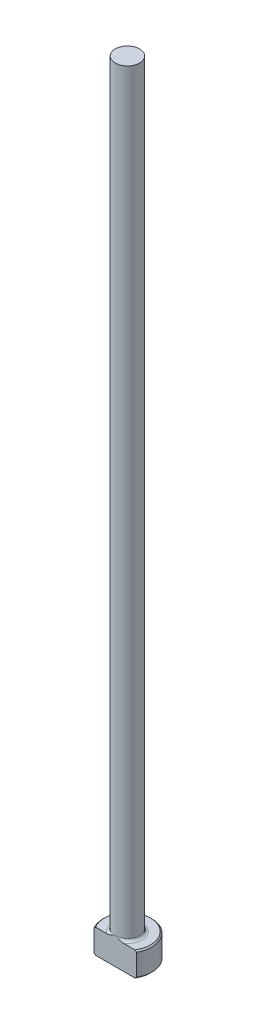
from build123d import *

# Parameters (mm, degrees)
CHAMFER1_SIZE = 0.254
FILLET1_R     = 0.508
KEY_DEPTH     = 153.548755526


with BuildPart() as part:
    # Sketch1 → Revolve1 (revolve)
    with BuildSketch(Plane.XY, mode=Mode.PRIVATE) as revolve1_sk:
        Polygon((0, 0), (-4.7625, 0), (-4.7625, 4.7498), (-2.38125, 4.7498), (-2.38125, 152.4), (0, 152.4), align=None)
    revolve(revolve1_sk.sketch.rotate(Axis((0, 259.958771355, 0), (0, -1, 0)), 270), axis=Axis((0, 259.958771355, 0), (0, -1, 0)))

    # Chamfer1
    chamfer1_edges = [part.edges().sort_by_distance(p)[0] for p in [
        (0, 4.7498, -4.7625),
        (0, 0, -4.7625),
    ]]
    chamfer(chamfer1_edges, length=CHAMFER1_SIZE)

    # Fillet1
    fillet1_edges = [part.edges().sort_by_distance(p)[0] for p in [
        (0, 4.7498, -2.38125),
    ]]
    fillet(fillet1_edges, radius=FILLET1_R)

    # Sketch2 → KEY (cut, through all)
    with BuildSketch(Plane.XZ):
        with BuildLine():
            Line((-4.124445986, 2.38125), (4.124445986, 2.38125))
            ThreePointArc((4.124445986, 2.38125), (0, 4.7625), (-4.124445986, 2.38125))
        make_face()
    extrude(amount=-KEY_DEPTH, mode=Mode.SUBTRACT)


solid = part.part
